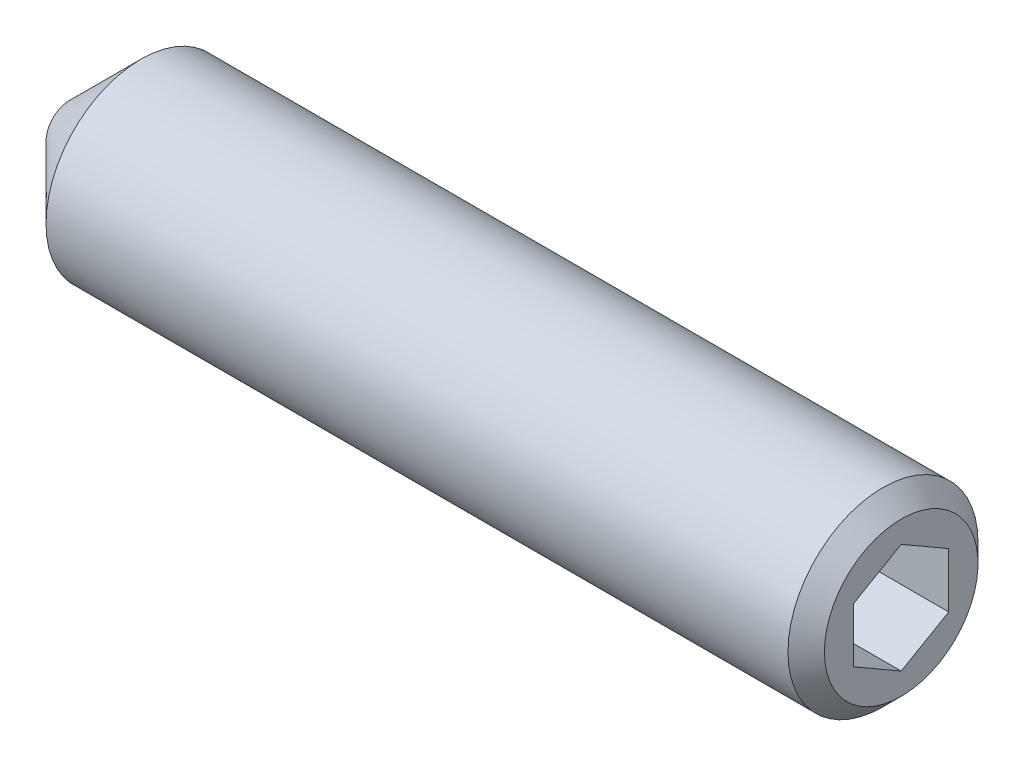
ISO-10303-21;
HEADER;
FILE_DESCRIPTION(('STEP AP214'),'2;1');
FILE_NAME('part.step','',(''),(''),'','','');
FILE_SCHEMA(('AUTOMOTIVE_DESIGN { 1 0 10303 214 1 1 1 1 }'));
ENDSEC;
DATA;
#1=APPLICATION_CONTEXT('core data for automotive mechanical design processes');
#2=APPLICATION_PROTOCOL_DEFINITION('international standard','automotive_design',2000,#1);
#3=PRODUCT_CONTEXT('',#1,'mechanical');
#4=PRODUCT('Part','Part','',(#3));
#5=PRODUCT_RELATED_PRODUCT_CATEGORY('part','',(#4));
#6=PRODUCT_DEFINITION_FORMATION('','',#4);
#7=PRODUCT_DEFINITION_CONTEXT('part definition',#1,'design');
#8=PRODUCT_DEFINITION('design','',#6,#7);
#9=PRODUCT_DEFINITION_SHAPE('','',#8);
#10=(LENGTH_UNIT() NAMED_UNIT(*) SI_UNIT(.MILLI.,.METRE.));
#11=(NAMED_UNIT(*) PLANE_ANGLE_UNIT() SI_UNIT($,.RADIAN.));
#12=(NAMED_UNIT(*) SI_UNIT($,.STERADIAN.) SOLID_ANGLE_UNIT());
#13=UNCERTAINTY_MEASURE_WITH_UNIT(LENGTH_MEASURE(1.E-05),#10,'distance_accuracy_value','');
#14=(GEOMETRIC_REPRESENTATION_CONTEXT(3) GLOBAL_UNCERTAINTY_ASSIGNED_CONTEXT((#13)) GLOBAL_UNIT_ASSIGNED_CONTEXT((#10,
#11,#12)) REPRESENTATION_CONTEXT('',''));
#15=CARTESIAN_POINT('',(0.,0.,0.));
#16=DIRECTION('',(0.,0.,1.));
#17=DIRECTION('',(1.,0.,0.));
#18=AXIS2_PLACEMENT_3D('',#15,#16,#17);
#19=CARTESIAN_POINT('',(30.0080000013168,0.,0.));
#20=DIRECTION('',(1.,0.,0.));
#21=DIRECTION('',(0.,0.,-1.));
#22=AXIS2_PLACEMENT_3D('',#19,#20,#21);
#23=CONICAL_SURFACE('',#22,2.32325748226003,1.04719754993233);
#24=CARTESIAN_POINT('',(28.6666666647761,-5.6843418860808E-11,0.));
#25=VERTEX_POINT('',#24);
#26=VERTEX_LOOP('',#25);
#27=FACE_BOUND('',#26,.T.);
#28=CARTESIAN_POINT('',(30.0000000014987,-1.1547005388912,1.999999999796));
#29=CARTESIAN_POINT('',(29.9706955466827,-1.20544263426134,1.9121121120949));
#30=CARTESIAN_POINT('',(29.9440446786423,-1.25662273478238,1.82346557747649));
#31=CARTESIAN_POINT('',(29.8975263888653,-1.35986908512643,1.64463765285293));
#32=CARTESIAN_POINT('',(29.8776754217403,-1.41193716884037,1.55445308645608));
#33=CARTESIAN_POINT('',(29.8467759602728,-1.51542808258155,1.37520156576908));
#34=CARTESIAN_POINT('',(29.8355217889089,-1.56683499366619,1.28616218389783));
#35=CARTESIAN_POINT('',(29.8220891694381,-1.66989057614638,1.10766467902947));
#36=CARTESIAN_POINT('',(29.8198995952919,-1.72153887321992,1.01820720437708));
#37=CARTESIAN_POINT('',(29.8244662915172,-1.81803817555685,0.851065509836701));
#38=CARTESIAN_POINT('',(29.8301012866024,-1.86290366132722,0.773356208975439));
#39=CARTESIAN_POINT('',(29.847957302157,-1.95234234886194,0.618443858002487));
#40=CARTESIAN_POINT('',(29.8601844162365,-1.99691524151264,0.541241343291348));
#41=CARTESIAN_POINT('',(29.8907498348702,-2.08653818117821,0.38600985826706));
#42=CARTESIAN_POINT('',(29.9092176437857,-2.13157689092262,0.308000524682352));
#43=CARTESIAN_POINT('',(29.9511317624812,-2.22098275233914,0.153145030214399));
#44=CARTESIAN_POINT('',(29.9745682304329,-2.26535104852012,0.0762968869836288));
#45=CARTESIAN_POINT('',(30.0000000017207,-2.30940107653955,3.79229382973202E-10));
#46=B_SPLINE_CURVE_WITH_KNOTS('',3,(#28,#29,#30,#31,#32,#33,#34,#35,#36,#37,#38,#39,#40,#41,#42,
#43,#44,#45),.UNSPECIFIED.,.F.,.F.,(4,2,2,2,2,2,2,2,4),(0.,0.317016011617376,0.63479381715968,
0.944707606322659,1.25424088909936,1.52370778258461,1.7934241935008,2.06912162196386,
2.34427797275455),.UNSPECIFIED.);
#47=CARTESIAN_POINT('',(30.000000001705,-1.15470053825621,1.99999999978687));
#48=VERTEX_POINT('',#47);
#49=CARTESIAN_POINT('',(30.0000000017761,-2.30940107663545,2.13120549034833E-10));
#50=VERTEX_POINT('',#49);
#51=EDGE_CURVE('E20',#48,#50,#46,.T.);
#52=ORIENTED_EDGE('',*,*,#51,.T.);
#53=CARTESIAN_POINT('',(30.0000000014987,-2.30940107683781,-5.4536099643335E-10));
#54=CARTESIAN_POINT('',(29.9706955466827,-2.25865898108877,-0.0878878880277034));
#55=CARTESIAN_POINT('',(29.9440446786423,-2.20747888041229,-0.176534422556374));
#56=CARTESIAN_POINT('',(29.8975263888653,-2.10423252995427,-0.355362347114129));
#57=CARTESIAN_POINT('',(29.8776754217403,-2.05216444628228,-0.445546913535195));
#58=CARTESIAN_POINT('',(29.8467759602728,-1.94867353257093,-0.624798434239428));
#59=CARTESIAN_POINT('',(29.8355217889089,-1.89726662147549,-0.713837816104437));
#60=CARTESIAN_POINT('',(29.8220891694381,-1.79421103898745,-0.892335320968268));
#61=CARTESIAN_POINT('',(29.8198995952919,-1.74256274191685,-0.981792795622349));
#62=CARTESIAN_POINT('',(29.8244662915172,-1.64606343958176,-1.14893449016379));
#63=CARTESIAN_POINT('',(29.8301012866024,-1.60119795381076,-1.22664379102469));
#64=CARTESIAN_POINT('',(29.847957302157,-1.51175926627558,-1.38155614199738));
#65=CARTESIAN_POINT('',(29.8601844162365,-1.46718637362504,-1.45875865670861));
#66=CARTESIAN_POINT('',(29.8907498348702,-1.37756343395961,-1.61399014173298));
#67=CARTESIAN_POINT('',(29.9092176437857,-1.33252472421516,-1.69199947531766));
#68=CARTESIAN_POINT('',(29.9511317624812,-1.24311886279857,-1.84685496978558));
#69=CARTESIAN_POINT('',(29.9745682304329,-1.19875056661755,-1.92370311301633));
#70=CARTESIAN_POINT('',(30.0000000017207,-1.1547005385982,-1.99999999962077));
#71=B_SPLINE_CURVE_WITH_KNOTS('',3,(#53,#54,#55,#56,#57,#58,#59,#60,#61,#62,#63,#64,#65,#66,#67,
#68,#69,#70),.UNSPECIFIED.,.F.,.F.,(4,2,2,2,2,2,2,2,4),(0.,0.317016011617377,0.634793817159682,
0.944707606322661,1.25424088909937,1.52370778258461,1.79342419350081,2.06912162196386,
2.34427797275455),.UNSPECIFIED.);
#72=CARTESIAN_POINT('',(30.0000000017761,-1.15470053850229,-1.99999999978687));
#73=VERTEX_POINT('',#72);
#74=EDGE_CURVE('E110',#50,#73,#71,.T.);
#75=ORIENTED_EDGE('',*,*,#74,.T.);
#76=CARTESIAN_POINT('',(30.0000000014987,-1.15470053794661,-2.00000000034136));
#77=CARTESIAN_POINT('',(29.9706955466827,-1.05321634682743,-2.0000000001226));
#78=CARTESIAN_POINT('',(29.9440446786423,-0.950856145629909,-2.00000000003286));
#79=CARTESIAN_POINT('',(29.8975263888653,-0.744363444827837,-1.99999999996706));
#80=CARTESIAN_POINT('',(29.8776754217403,-0.640227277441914,-1.99999999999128));
#81=CARTESIAN_POINT('',(29.8467759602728,-0.43324544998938,-2.0000000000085));
#82=CARTESIAN_POINT('',(29.8355217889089,-0.330431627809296,-2.00000000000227));
#83=CARTESIAN_POINT('',(29.8220891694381,-0.124320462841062,-1.99999999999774));
#84=CARTESIAN_POINT('',(29.8198995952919,-0.0210238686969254,-1.99999999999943));
#85=CARTESIAN_POINT('',(29.8244662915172,0.171974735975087,-2.0000000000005));
#86=CARTESIAN_POINT('',(29.8301012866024,0.261705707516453,-2.00000000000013));
#87=CARTESIAN_POINT('',(29.847957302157,0.440583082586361,-1.99999999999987));
#88=CARTESIAN_POINT('',(29.8601844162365,0.5297288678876,-1.99999999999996));
#89=CARTESIAN_POINT('',(29.8907498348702,0.7089747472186,-2.00000000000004));
#90=CARTESIAN_POINT('',(29.9092176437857,0.799052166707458,-2.00000000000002));
#91=CARTESIAN_POINT('',(29.9511317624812,0.977863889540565,-1.99999999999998));
#92=CARTESIAN_POINT('',(29.9745682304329,1.06660048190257,-1.99999999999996));
#93=CARTESIAN_POINT('',(30.0000000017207,1.15470053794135,-2.));
#94=B_SPLINE_CURVE_WITH_KNOTS('',3,(#76,#77,#78,#79,#80,#81,#82,#83,#84,#85,#86,#87,#88,#89,#90,
#91,#92,#93),.UNSPECIFIED.,.F.,.F.,(4,2,2,2,2,2,2,2,4),(0.,0.317016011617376,0.634793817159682,
0.944707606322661,1.25424088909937,1.52370778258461,1.79342419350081,2.06912162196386,
2.34427797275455),.UNSPECIFIED.);
#95=CARTESIAN_POINT('',(30.0000000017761,1.15470053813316,-2.));
#96=VERTEX_POINT('',#95);
#97=EDGE_CURVE('E106',#73,#96,#94,.T.);
#98=ORIENTED_EDGE('',*,*,#97,.T.);
#99=CARTESIAN_POINT('',(30.0000000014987,1.1547005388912,-1.999999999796));
#100=CARTESIAN_POINT('',(29.9706955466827,1.20544263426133,-1.9121121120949));
#101=CARTESIAN_POINT('',(29.9440446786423,1.25662273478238,-1.82346557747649));
#102=CARTESIAN_POINT('',(29.8975263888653,1.35986908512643,-1.64463765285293));
#103=CARTESIAN_POINT('',(29.8776754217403,1.41193716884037,-1.55445308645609));
#104=CARTESIAN_POINT('',(29.8467759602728,1.51542808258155,-1.37520156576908));
#105=CARTESIAN_POINT('',(29.8355217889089,1.56683499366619,-1.28616218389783));
#106=CARTESIAN_POINT('',(29.8220891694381,1.66989057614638,-1.10766467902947));
#107=CARTESIAN_POINT('',(29.8198995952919,1.72153887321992,-1.01820720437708));
#108=CARTESIAN_POINT('',(29.8244662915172,1.81803817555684,-0.851065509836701));
#109=CARTESIAN_POINT('',(29.8301012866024,1.86290366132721,-0.773356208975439));
#110=CARTESIAN_POINT('',(29.847957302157,1.95234234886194,-0.618443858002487));
#111=CARTESIAN_POINT('',(29.8601844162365,1.99691524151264,-0.541241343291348));
#112=CARTESIAN_POINT('',(29.8907498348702,2.0865381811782,-0.386009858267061));
#113=CARTESIAN_POINT('',(29.9092176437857,2.13157689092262,-0.308000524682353));
#114=CARTESIAN_POINT('',(29.9511317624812,2.22098275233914,-0.153145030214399));
#115=CARTESIAN_POINT('',(29.9745682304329,2.26535104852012,-0.0762968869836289));
#116=CARTESIAN_POINT('',(30.0000000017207,2.30940107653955,-3.79228752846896E-10));
#117=B_SPLINE_CURVE_WITH_KNOTS('',3,(#99,#100,#101,#102,#103,#104,#105,#106,#107,#108,#109,#110,
#111,#112,#113,#114,#115,#116),.UNSPECIFIED.,.F.,.F.,(4,2,2,2,2,2,2,2,4),(0.,0.317016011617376,
0.634793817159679,0.944707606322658,1.25424088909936,1.52370778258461,1.7934241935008,
2.06912162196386,2.34427797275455),.UNSPECIFIED.);
#118=CARTESIAN_POINT('',(30.0000000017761,2.30940107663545,-2.13123895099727E-10));
#119=VERTEX_POINT('',#118);
#120=EDGE_CURVE('E102',#96,#119,#117,.T.);
#121=ORIENTED_EDGE('',*,*,#120,.T.);
#122=CARTESIAN_POINT('',(30.0000000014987,2.3094010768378,5.45357617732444E-10));
#123=CARTESIAN_POINT('',(29.9706955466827,2.25865898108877,0.0878878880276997));
#124=CARTESIAN_POINT('',(29.9440446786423,2.20747888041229,0.17653442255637));
#125=CARTESIAN_POINT('',(29.8975263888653,2.10423252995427,0.355362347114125));
#126=CARTESIAN_POINT('',(29.8776754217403,2.05216444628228,0.445546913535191));
#127=CARTESIAN_POINT('',(29.8467759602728,1.94867353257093,0.624798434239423));
#128=CARTESIAN_POINT('',(29.8355217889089,1.89726662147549,0.713837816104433));
#129=CARTESIAN_POINT('',(29.8220891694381,1.79421103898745,0.892335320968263));
#130=CARTESIAN_POINT('',(29.8198995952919,1.74256274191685,0.981792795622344));
#131=CARTESIAN_POINT('',(29.8244662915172,1.64606343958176,1.14893449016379));
#132=CARTESIAN_POINT('',(29.8301012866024,1.60119795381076,1.22664379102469));
#133=CARTESIAN_POINT('',(29.847957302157,1.51175926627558,1.38155614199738));
#134=CARTESIAN_POINT('',(29.8601844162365,1.46718637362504,1.45875865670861));
#135=CARTESIAN_POINT('',(29.8907498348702,1.37756343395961,1.61399014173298));
#136=CARTESIAN_POINT('',(29.9092176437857,1.33252472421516,1.69199947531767));
#137=CARTESIAN_POINT('',(29.9511317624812,1.24311886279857,1.84685496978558));
#138=CARTESIAN_POINT('',(29.9745682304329,1.19875056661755,1.92370311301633));
#139=CARTESIAN_POINT('',(30.0000000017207,1.15470053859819,1.99999999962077));
#140=B_SPLINE_CURVE_WITH_KNOTS('',3,(#122,#123,#124,#125,#126,#127,#128,#129,#130,#131,#132,
#133,#134,#135,#136,#137,#138,#139),.UNSPECIFIED.,.F.,.F.,(4,2,2,2,2,2,2,2,4),(0.,
0.317016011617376,0.634793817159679,0.944707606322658,1.25424088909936,1.52370778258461,
1.79342419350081,2.06912162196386,2.34427797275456),.UNSPECIFIED.);
#141=CARTESIAN_POINT('',(30.0000000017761,1.15470053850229,1.99999999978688));
#142=VERTEX_POINT('',#141);
#143=EDGE_CURVE('E85',#119,#142,#140,.T.);
#144=ORIENTED_EDGE('',*,*,#143,.T.);
#145=CARTESIAN_POINT('',(30.0000000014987,1.1547005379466,2.00000000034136));
#146=CARTESIAN_POINT('',(29.9706955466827,1.05321634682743,2.0000000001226));
#147=CARTESIAN_POINT('',(29.9440446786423,0.950856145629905,2.00000000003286));
#148=CARTESIAN_POINT('',(29.8975263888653,0.744363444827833,1.99999999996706));
#149=CARTESIAN_POINT('',(29.8776754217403,0.640227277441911,1.99999999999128));
#150=CARTESIAN_POINT('',(29.8467759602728,0.433245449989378,2.0000000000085));
#151=CARTESIAN_POINT('',(29.8355217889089,0.330431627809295,2.00000000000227));
#152=CARTESIAN_POINT('',(29.8220891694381,0.124320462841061,1.99999999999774));
#153=CARTESIAN_POINT('',(29.8198995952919,0.0210238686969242,1.99999999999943));
#154=CARTESIAN_POINT('',(29.8244662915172,-0.171974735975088,2.0000000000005));
#155=CARTESIAN_POINT('',(29.8301012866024,-0.261705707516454,2.00000000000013));
#156=CARTESIAN_POINT('',(29.847957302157,-0.440583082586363,1.99999999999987));
#157=CARTESIAN_POINT('',(29.8601844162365,-0.529728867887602,1.99999999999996));
#158=CARTESIAN_POINT('',(29.8907498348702,-0.708974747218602,2.00000000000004));
#159=CARTESIAN_POINT('',(29.9092176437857,-0.799052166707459,2.00000000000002));
#160=CARTESIAN_POINT('',(29.9511317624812,-0.977863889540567,1.99999999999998));
#161=CARTESIAN_POINT('',(29.9745682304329,-1.06660048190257,1.99999999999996));
#162=CARTESIAN_POINT('',(30.0000000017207,-1.15470053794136,2.));
#163=B_SPLINE_CURVE_WITH_KNOTS('',3,(#145,#146,#147,#148,#149,#150,#151,#152,#153,#154,#155,
#156,#157,#158,#159,#160,#161,#162),.UNSPECIFIED.,.F.,.F.,(4,2,2,2,2,2,2,2,4),(0.,
0.317016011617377,0.63479381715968,0.944707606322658,1.25424088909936,1.52370778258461,
1.7934241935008,2.06912162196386,2.34427797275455),.UNSPECIFIED.);
#164=EDGE_CURVE('E83',#142,#48,#163,.T.);
#165=ORIENTED_EDGE('',*,*,#164,.T.);
#166=EDGE_LOOP('',(#52,#75,#98,#121,#144,#165));
#167=FACE_BOUND('',#166,.T.);
#168=ADVANCED_FACE('F16',(#27,#167),#23,.F.);
#169=CARTESIAN_POINT('',(35.,-1.15470053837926,1.99999999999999));
#170=DIRECTION('',(0.,-0.86602540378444,0.499999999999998));
#171=DIRECTION('',(0.,-0.499999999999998,-0.86602540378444));
#172=AXIS2_PLACEMENT_3D('',#169,#170,#171);
#173=PLANE('',#172);
#174=DIRECTION('',(1.,0.,0.));
#175=VECTOR('',#174,1.);
#176=CARTESIAN_POINT('',(35.,-1.15470053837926,2.));
#177=LINE('',#176,#175);
#178=CARTESIAN_POINT('',(35.,-1.15470053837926,2.));
#179=VERTEX_POINT('',#178);
#180=EDGE_CURVE('E76',#48,#179,#177,.T.);
#181=ORIENTED_EDGE('',*,*,#180,.T.);
#182=DIRECTION('',(0.,-0.499999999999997,-0.86602540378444));
#183=VECTOR('',#182,1.);
#184=CARTESIAN_POINT('',(35.,-1.15470053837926,1.99999999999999));
#185=LINE('',#184,#183);
#186=CARTESIAN_POINT('',(35.,-2.3094010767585,0.));
#187=VERTEX_POINT('',#186);
#188=EDGE_CURVE('E87',#179,#187,#185,.T.);
#189=ORIENTED_EDGE('',*,*,#188,.T.);
#190=DIRECTION('',(1.,0.,0.));
#191=VECTOR('',#190,1.);
#192=CARTESIAN_POINT('',(35.,-2.3094010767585,0.));
#193=LINE('',#192,#191);
#194=EDGE_CURVE('E79',#187,#50,#193,.F.);
#195=ORIENTED_EDGE('',*,*,#194,.T.);
#196=ORIENTED_EDGE('',*,*,#51,.F.);
#197=EDGE_LOOP('',(#181,#189,#195,#196));
#198=FACE_BOUND('',#197,.T.);
#199=ADVANCED_FACE('F74',(#198),#173,.F.);
#200=CARTESIAN_POINT('',(35.,-2.3094010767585,0.));
#201=DIRECTION('',(0.,-0.866025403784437,-0.500000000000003));
#202=DIRECTION('',(0.,0.500000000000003,-0.866025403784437));
#203=AXIS2_PLACEMENT_3D('',#200,#201,#202);
#204=PLANE('',#203);
#205=ORIENTED_EDGE('',*,*,#194,.F.);
#206=DIRECTION('',(0.,0.500000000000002,-0.866025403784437));
#207=VECTOR('',#206,1.);
#208=CARTESIAN_POINT('',(35.,-2.3094010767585,0.));
#209=LINE('',#208,#207);
#210=CARTESIAN_POINT('',(35.,-1.15470053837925,-2.));
#211=VERTEX_POINT('',#210);
#212=EDGE_CURVE('E117',#187,#211,#209,.T.);
#213=ORIENTED_EDGE('',*,*,#212,.T.);
#214=DIRECTION('',(-1.,0.,0.));
#215=VECTOR('',#214,1.);
#216=CARTESIAN_POINT('',(35.,-1.15470053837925,-2.));
#217=LINE('',#216,#215);
#218=EDGE_CURVE('E107',#211,#73,#217,.T.);
#219=ORIENTED_EDGE('',*,*,#218,.T.);
#220=ORIENTED_EDGE('',*,*,#74,.F.);
#221=EDGE_LOOP('',(#205,#213,#219,#220));
#222=FACE_BOUND('',#221,.T.);
#223=ADVANCED_FACE('F162',(#222),#204,.F.);
#224=CARTESIAN_POINT('',(35.,-1.15470053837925,-2.));
#225=DIRECTION('',(0.,0.,-1.));
#226=DIRECTION('',(-1.,0.,0.));
#227=AXIS2_PLACEMENT_3D('',#224,#225,#226);
#228=PLANE('',#227);
#229=ORIENTED_EDGE('',*,*,#218,.F.);
#230=DIRECTION('',(0.,1.,0.));
#231=VECTOR('',#230,1.);
#232=CARTESIAN_POINT('',(35.,0.,-2.));
#233=LINE('',#232,#231);
#234=CARTESIAN_POINT('',(35.,1.15470053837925,-2.));
#235=VERTEX_POINT('',#234);
#236=EDGE_CURVE('E119',#211,#235,#233,.T.);
#237=ORIENTED_EDGE('',*,*,#236,.T.);
#238=DIRECTION('',(1.,0.,0.));
#239=VECTOR('',#238,1.);
#240=CARTESIAN_POINT('',(35.,1.15470053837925,-1.99999999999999));
#241=LINE('',#240,#239);
#242=EDGE_CURVE('E103',#235,#96,#241,.F.);
#243=ORIENTED_EDGE('',*,*,#242,.T.);
#244=ORIENTED_EDGE('',*,*,#97,.F.);
#245=EDGE_LOOP('',(#229,#237,#243,#244));
#246=FACE_BOUND('',#245,.T.);
#247=ADVANCED_FACE('F148',(#246),#228,.F.);
#248=CARTESIAN_POINT('',(35.,1.15470053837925,-1.99999999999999));
#249=DIRECTION('',(0.,0.86602540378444,-0.499999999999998));
#250=DIRECTION('',(0.,0.499999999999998,0.86602540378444));
#251=AXIS2_PLACEMENT_3D('',#248,#249,#250);
#252=PLANE('',#251);
#253=ORIENTED_EDGE('',*,*,#242,.F.);
#254=DIRECTION('',(0.,0.5,0.866025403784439));
#255=VECTOR('',#254,1.);
#256=CARTESIAN_POINT('',(35.,1.15470053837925,-1.99999999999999));
#257=LINE('',#256,#255);
#258=CARTESIAN_POINT('',(35.,2.3094010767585,0.));
#259=VERTEX_POINT('',#258);
#260=EDGE_CURVE('E113',#235,#259,#257,.T.);
#261=ORIENTED_EDGE('',*,*,#260,.T.);
#262=DIRECTION('',(1.,0.,0.));
#263=VECTOR('',#262,1.);
#264=CARTESIAN_POINT('',(35.,2.3094010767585,0.));
#265=LINE('',#264,#263);
#266=EDGE_CURVE('E96',#259,#119,#265,.F.);
#267=ORIENTED_EDGE('',*,*,#266,.T.);
#268=ORIENTED_EDGE('',*,*,#120,.F.);
#269=EDGE_LOOP('',(#253,#261,#267,#268));
#270=FACE_BOUND('',#269,.T.);
#271=ADVANCED_FACE('F144',(#270),#252,.F.);
#272=CARTESIAN_POINT('',(35.,2.3094010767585,0.));
#273=DIRECTION('',(0.,0.866025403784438,0.500000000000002));
#274=DIRECTION('',(0.,-0.500000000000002,0.866025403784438));
#275=AXIS2_PLACEMENT_3D('',#272,#273,#274);
#276=PLANE('',#275);
#277=ORIENTED_EDGE('',*,*,#266,.F.);
#278=DIRECTION('',(0.,-0.500000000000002,0.866025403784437));
#279=VECTOR('',#278,1.);
#280=CARTESIAN_POINT('',(35.,2.3094010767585,0.));
#281=LINE('',#280,#279);
#282=CARTESIAN_POINT('',(35.,1.15470053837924,2.));
#283=VERTEX_POINT('',#282);
#284=EDGE_CURVE('E38',#259,#283,#281,.T.);
#285=ORIENTED_EDGE('',*,*,#284,.T.);
#286=DIRECTION('',(1.,0.,0.));
#287=VECTOR('',#286,1.);
#288=CARTESIAN_POINT('',(35.,1.15470053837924,2.));
#289=LINE('',#288,#287);
#290=EDGE_CURVE('E88',#283,#142,#289,.F.);
#291=ORIENTED_EDGE('',*,*,#290,.T.);
#292=ORIENTED_EDGE('',*,*,#143,.F.);
#293=EDGE_LOOP('',(#277,#285,#291,#292));
#294=FACE_BOUND('',#293,.T.);
#295=ADVANCED_FACE('F139',(#294),#276,.F.);
#296=CARTESIAN_POINT('',(35.,1.15470053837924,2.));
#297=DIRECTION('',(0.,0.,1.));
#298=DIRECTION('',(1.,0.,0.));
#299=AXIS2_PLACEMENT_3D('',#296,#297,#298);
#300=PLANE('',#299);
#301=ORIENTED_EDGE('',*,*,#290,.F.);
#302=DIRECTION('',(0.,1.,0.));
#303=VECTOR('',#302,1.);
#304=CARTESIAN_POINT('',(35.,0.,2.));
#305=LINE('',#304,#303);
#306=EDGE_CURVE('E92',#283,#179,#305,.F.);
#307=ORIENTED_EDGE('',*,*,#306,.T.);
#308=ORIENTED_EDGE('',*,*,#180,.F.);
#309=ORIENTED_EDGE('',*,*,#164,.F.);
#310=EDGE_LOOP('',(#301,#307,#308,#309));
#311=FACE_BOUND('',#310,.T.);
#312=ADVANCED_FACE('F90',(#311),#300,.F.);
#313=CARTESIAN_POINT('',(0.,2.,0.));
#314=DIRECTION('',(-1.,0.,0.));
#315=DIRECTION('',(0.,0.,1.));
#316=AXIS2_PLACEMENT_3D('',#313,#314,#315);
#317=PLANE('',#316);
#318=CARTESIAN_POINT('',(-1.30739863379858E-09,0.,0.));
#319=DIRECTION('',(1.,0.,0.));
#320=DIRECTION('',(0.,0.,-1.));
#321=AXIS2_PLACEMENT_3D('',#318,#319,#320);
#322=CIRCLE('',#321,1.00000000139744);
#323=CARTESIAN_POINT('',(-1.30739863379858E-09,0.,-1.00000000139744));
#324=VERTEX_POINT('',#323);
#325=EDGE_CURVE('E115',#324,#324,#322,.T.);
#326=ORIENTED_EDGE('',*,*,#325,.F.);
#327=EDGE_LOOP('',(#326));
#328=FACE_BOUND('',#327,.T.);
#329=ADVANCED_FACE('F138',(#328),#317,.T.);
#330=CARTESIAN_POINT('',(35.,0.,0.));
#331=DIRECTION('',(-1.,0.,0.));
#332=DIRECTION('',(0.,0.,1.));
#333=AXIS2_PLACEMENT_3D('',#330,#331,#332);
#334=PLANE('',#333);
#335=ORIENTED_EDGE('',*,*,#284,.F.);
#336=ORIENTED_EDGE('',*,*,#260,.F.);
#337=ORIENTED_EDGE('',*,*,#236,.F.);
#338=ORIENTED_EDGE('',*,*,#212,.F.);
#339=ORIENTED_EDGE('',*,*,#188,.F.);
#340=ORIENTED_EDGE('',*,*,#306,.F.);
#341=EDGE_LOOP('',(#335,#336,#337,#338,#339,#340));
#342=FACE_BOUND('',#341,.T.);
#343=CARTESIAN_POINT('',(35.0000000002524,0.,0.));
#344=DIRECTION('',(-1.,0.,0.));
#345=DIRECTION('',(0.,0.,1.));
#346=AXIS2_PLACEMENT_3D('',#343,#344,#345);
#347=CIRCLE('',#346,3.23318750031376);
#348=CARTESIAN_POINT('',(35.0000000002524,0.,3.23318750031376));
#349=VERTEX_POINT('',#348);
#350=EDGE_CURVE('E122',#349,#349,#347,.T.);
#351=ORIENTED_EDGE('',*,*,#350,.F.);
#352=EDGE_LOOP('',(#351));
#353=FACE_BOUND('',#352,.T.);
#354=ADVANCED_FACE('F187',(#342,#353),#334,.F.);
#355=CARTESIAN_POINT('',(3.00000000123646,0.,0.));
#356=DIRECTION('',(1.,0.,0.));
#357=DIRECTION('',(0.,0.,-1.));
#358=AXIS2_PLACEMENT_3D('',#355,#356,#357);
#359=CONICAL_SURFACE('',#358,3.99999999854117,0.785398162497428);
#360=CARTESIAN_POINT('',(3.,0.,0.));
#361=DIRECTION('',(1.,0.,0.));
#362=DIRECTION('',(0.,1.,0.));
#363=AXIS2_PLACEMENT_3D('',#360,#361,#362);
#364=CIRCLE('',#363,4.);
#365=CARTESIAN_POINT('',(3.,0.,-3.99999999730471));
#366=VERTEX_POINT('',#365);
#367=EDGE_CURVE('E29',#366,#366,#364,.T.);
#368=CARTESIAN_POINT('',(3.,0.,-3.99999999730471));
#369=CARTESIAN_POINT('',(2.96874999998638,0.,-3.96874999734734));
#370=CARTESIAN_POINT('',(2.93749999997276,0.,-3.93749999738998));
#371=CARTESIAN_POINT('',(2.87499999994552,0.,-3.87499999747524));
#372=CARTESIAN_POINT('',(2.84374999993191,0.,-3.84374999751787));
#373=CARTESIAN_POINT('',(2.78124999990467,0.,-3.78124999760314));
#374=CARTESIAN_POINT('',(2.74999999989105,0.,-3.74999999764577));
#375=CARTESIAN_POINT('',(2.68749999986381,0.,-3.68749999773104));
#376=CARTESIAN_POINT('',(2.65624999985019,0.,-3.65624999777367));
#377=CARTESIAN_POINT('',(2.59374999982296,0.,-3.59374999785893));
#378=CARTESIAN_POINT('',(2.56249999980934,0.,-3.56249999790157));
#379=CARTESIAN_POINT('',(2.4999999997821,0.,-3.49999999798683));
#380=CARTESIAN_POINT('',(2.46874999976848,0.,-3.46874999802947));
#381=CARTESIAN_POINT('',(2.40624999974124,0.,-3.40624999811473));
#382=CARTESIAN_POINT('',(2.37499999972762,0.,-3.37499999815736));
#383=CARTESIAN_POINT('',(2.31249999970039,0.,-3.31249999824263));
#384=CARTESIAN_POINT('',(2.28124999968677,0.,-3.28124999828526));
#385=CARTESIAN_POINT('',(2.21874999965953,0.,-3.21874999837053));
#386=CARTESIAN_POINT('',(2.18749999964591,0.,-3.18749999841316));
#387=CARTESIAN_POINT('',(2.12499999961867,0.,-3.12499999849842));
#388=CARTESIAN_POINT('',(2.09374999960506,0.,-3.09374999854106));
#389=CARTESIAN_POINT('',(2.03124999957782,0.,-3.03124999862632));
#390=CARTESIAN_POINT('',(1.9999999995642,0.,-2.99999999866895));
#391=CARTESIAN_POINT('',(1.93749999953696,0.,-2.93749999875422));
#392=CARTESIAN_POINT('',(1.90624999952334,0.,-2.90624999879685));
#393=CARTESIAN_POINT('',(1.84374999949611,0.,-2.84374999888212));
#394=CARTESIAN_POINT('',(1.81249999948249,0.,-2.81249999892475));
#395=CARTESIAN_POINT('',(1.74999999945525,0.,-2.74999999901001));
#396=CARTESIAN_POINT('',(1.71874999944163,0.,-2.71874999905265));
#397=CARTESIAN_POINT('',(1.65624999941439,0.,-2.65624999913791));
#398=CARTESIAN_POINT('',(1.62499999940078,0.,-2.62499999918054));
#399=CARTESIAN_POINT('',(1.56249999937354,0.,-2.56249999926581));
#400=CARTESIAN_POINT('',(1.53124999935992,0.,-2.53124999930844));
#401=CARTESIAN_POINT('',(1.46874999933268,0.,-2.46874999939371));
#402=CARTESIAN_POINT('',(1.43749999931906,0.,-2.43749999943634));
#403=CARTESIAN_POINT('',(1.37499999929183,0.,-2.37499999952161));
#404=CARTESIAN_POINT('',(1.34374999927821,0.,-2.34374999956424));
#405=CARTESIAN_POINT('',(1.28124999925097,0.,-2.2812499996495));
#406=CARTESIAN_POINT('',(1.24999999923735,0.,-2.24999999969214));
#407=CARTESIAN_POINT('',(1.18749999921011,0.,-2.1874999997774));
#408=CARTESIAN_POINT('',(1.15624999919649,0.,-2.15624999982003));
#409=CARTESIAN_POINT('',(1.09374999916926,0.,-2.0937499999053));
#410=CARTESIAN_POINT('',(1.06249999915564,0.,-2.06249999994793));
#411=CARTESIAN_POINT('',(0.999999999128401,0.,-2.0000000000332));
#412=CARTESIAN_POINT('',(0.968749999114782,0.,-1.96875000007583));
#413=CARTESIAN_POINT('',(0.906249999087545,0.,-1.90625000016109));
#414=CARTESIAN_POINT('',(0.874999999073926,0.,-1.87500000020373));
#415=CARTESIAN_POINT('',(0.812499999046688,0.,-1.81250000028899));
#416=CARTESIAN_POINT('',(0.78124999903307,0.,-1.78125000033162));
#417=CARTESIAN_POINT('',(0.718749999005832,0.,-1.71875000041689));
#418=CARTESIAN_POINT('',(0.687499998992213,0.,-1.68750000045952));
#419=CARTESIAN_POINT('',(0.624999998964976,0.,-1.62500000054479));
#420=CARTESIAN_POINT('',(0.593749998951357,0.,-1.59375000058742));
#421=CARTESIAN_POINT('',(0.53124999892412,0.,-1.53125000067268));
#422=CARTESIAN_POINT('',(0.499999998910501,0.,-1.50000000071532));
#423=CARTESIAN_POINT('',(0.437499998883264,0.,-1.43750000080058));
#424=CARTESIAN_POINT('',(0.406249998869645,0.,-1.40625000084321));
#425=CARTESIAN_POINT('',(0.343749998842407,0.,-1.34375000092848));
#426=CARTESIAN_POINT('',(0.312499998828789,0.,-1.31250000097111));
#427=CARTESIAN_POINT('',(0.249999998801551,0.,-1.25000000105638));
#428=CARTESIAN_POINT('',(0.218749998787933,0.,-1.21875000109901));
#429=CARTESIAN_POINT('',(0.156249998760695,0.,-1.15625000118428));
#430=CARTESIAN_POINT('',(0.124999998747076,0.,-1.12500000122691));
#431=CARTESIAN_POINT('',(0.0624999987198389,0.,-1.06250000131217));
#432=CARTESIAN_POINT('',(0.0312499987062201,0.,-1.03125000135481));
#433=CARTESIAN_POINT('',(-1.30739863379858E-09,0.,-1.00000000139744));
#434=B_SPLINE_CURVE_WITH_KNOTS('',3,(#368,#369,#370,#371,#372,#373,#374,#375,#376,#377,#378,
#379,#380,#381,#382,#383,#384,#385,#386,#387,#388,#389,#390,#391,#392,#393,#394,#395,#396,#397,
#398,#399,#400,#401,#402,#403,#404,#405,#406,#407,#408,#409,#410,#411,#412,#413,#414,#415,#416,
#417,#418,#419,#420,#421,#422,#423,#424,#425,#426,#427,#428,#429,#430,#431,#432,#433),
.UNSPECIFIED.,.F.,.F.,(4,2,2,2,2,2,2,2,2,2,2,2,2,2,2,2,2,2,2,2,2,2,2,2,2,2,2,2,2,2,2,2,4),(0.,
0.13258252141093,0.26516504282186,0.39774756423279,0.53033008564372,0.66291260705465,
0.79549512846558,0.92807764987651,1.06066017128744,1.19324269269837,1.3258252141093,
1.45840773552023,1.59099025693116,1.72357277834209,1.85615529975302,1.98873782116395,
2.12132034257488,2.25390286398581,2.38648538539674,2.51906790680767,2.6516504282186,
2.78423294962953,2.91681547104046,3.04939799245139,3.18198051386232,3.31456303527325,
3.44714555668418,3.57972807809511,3.71231059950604,3.84489312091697,3.9774756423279,
4.11005816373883,4.24264068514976),.UNSPECIFIED.);
#435=EDGE_CURVE('BSEAM181',#366,#324,#434,.T.);
#436=ORIENTED_EDGE('',*,*,#367,.F.);
#437=ORIENTED_EDGE('',*,*,#325,.T.);
#438=ORIENTED_EDGE('',*,*,#435,.T.);
#439=ORIENTED_EDGE('',*,*,#435,.F.);
#440=EDGE_LOOP('',(#436,#438,#437,#439));
#441=FACE_BOUND('',#440,.T.);
#442=ADVANCED_FACE('F181',(#441),#359,.T.);
#443=CARTESIAN_POINT('',(34.2331874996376,0.,0.));
#444=DIRECTION('',(-1.,0.,0.));
#445=DIRECTION('',(0.,0.,1.));
#446=AXIS2_PLACEMENT_3D('',#443,#444,#445);
#447=CONICAL_SURFACE('',#446,3.9999999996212,0.785398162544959);
#448=ORIENTED_EDGE('',*,*,#350,.T.);
#449=EDGE_LOOP('',(#448));
#450=FACE_BOUND('',#449,.T.);
#451=CARTESIAN_POINT('',(34.2331875,0.,0.));
#452=DIRECTION('',(1.,0.,0.));
#453=DIRECTION('',(0.,1.,0.));
#454=AXIS2_PLACEMENT_3D('',#451,#452,#453);
#455=CIRCLE('',#454,4.);
#456=CARTESIAN_POINT('',(34.2331875,4.,0.));
#457=VERTEX_POINT('',#456);
#458=EDGE_CURVE('E11',#457,#457,#455,.F.);
#459=ORIENTED_EDGE('',*,*,#458,.F.);
#460=EDGE_LOOP('',(#459));
#461=FACE_BOUND('',#460,.T.);
#462=ADVANCED_FACE('F175',(#450,#461),#447,.T.);
#463=CARTESIAN_POINT('',(17.5,0.,0.));
#464=DIRECTION('',(1.,0.,0.));
#465=DIRECTION('',(0.,1.,0.));
#466=AXIS2_PLACEMENT_3D('',#463,#464,#465);
#467=CYLINDRICAL_SURFACE('',#466,4.);
#468=ORIENTED_EDGE('',*,*,#458,.T.);
#469=EDGE_LOOP('',(#468));
#470=FACE_BOUND('',#469,.T.);
#471=ORIENTED_EDGE('',*,*,#367,.T.);
#472=EDGE_LOOP('',(#471));
#473=FACE_BOUND('',#472,.T.);
#474=ADVANCED_FACE('F173',(#470,#473),#467,.T.);
#475=CLOSED_SHELL('',(#168,#199,#223,#247,#271,#295,#312,#329,#354,#442,#462,#474));
#476=MANIFOLD_SOLID_BREP('B1',#475);
#477=ADVANCED_BREP_SHAPE_REPRESENTATION('',(#18,#476),#14);
#478=SHAPE_DEFINITION_REPRESENTATION(#9,#477);
ENDSEC;
END-ISO-10303-21;
